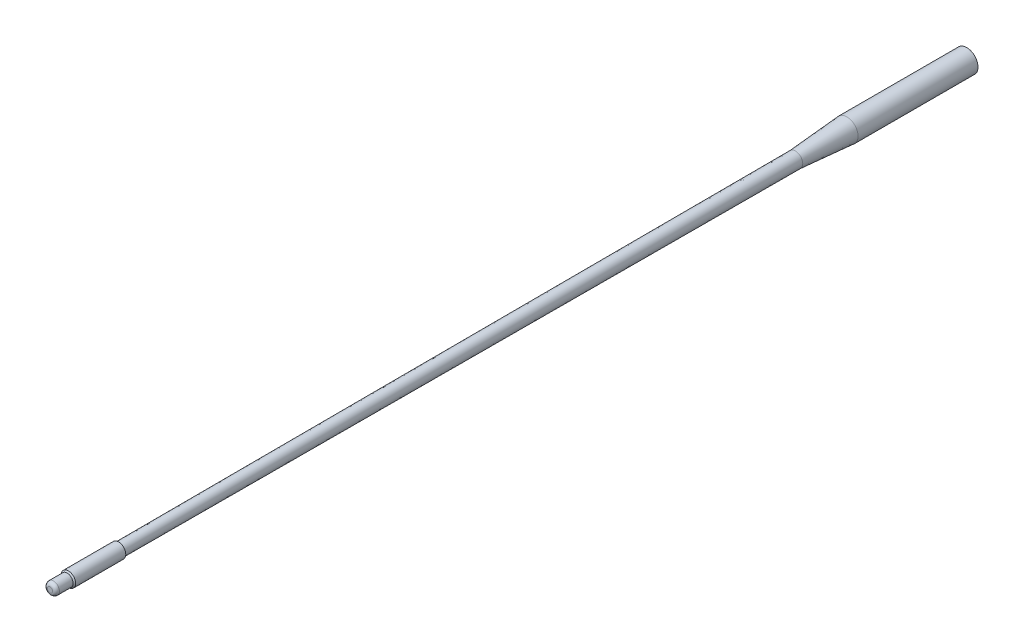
ISO-10303-21;
HEADER;
FILE_DESCRIPTION(('STEP AP214'),'2;1');
FILE_NAME('part.step','',(''),(''),'','','');
FILE_SCHEMA(('AUTOMOTIVE_DESIGN { 1 0 10303 214 1 1 1 1 }'));
ENDSEC;
DATA;
#1=APPLICATION_CONTEXT('core data for automotive mechanical design processes');
#2=APPLICATION_PROTOCOL_DEFINITION('international standard','automotive_design',2000,#1);
#3=PRODUCT_CONTEXT('',#1,'mechanical');
#4=PRODUCT('Part','Part','',(#3));
#5=PRODUCT_RELATED_PRODUCT_CATEGORY('part','',(#4));
#6=PRODUCT_DEFINITION_FORMATION('','',#4);
#7=PRODUCT_DEFINITION_CONTEXT('part definition',#1,'design');
#8=PRODUCT_DEFINITION('design','',#6,#7);
#9=PRODUCT_DEFINITION_SHAPE('','',#8);
#10=(LENGTH_UNIT() NAMED_UNIT(*) SI_UNIT(.MILLI.,.METRE.));
#11=(NAMED_UNIT(*) PLANE_ANGLE_UNIT() SI_UNIT($,.RADIAN.));
#12=(NAMED_UNIT(*) SI_UNIT($,.STERADIAN.) SOLID_ANGLE_UNIT());
#13=UNCERTAINTY_MEASURE_WITH_UNIT(LENGTH_MEASURE(1.E-05),#10,'distance_accuracy_value','');
#14=(GEOMETRIC_REPRESENTATION_CONTEXT(3) GLOBAL_UNCERTAINTY_ASSIGNED_CONTEXT((#13)) GLOBAL_UNIT_ASSIGNED_CONTEXT((#10,
#11,#12)) REPRESENTATION_CONTEXT('',''));
#15=CARTESIAN_POINT('',(0.,0.,0.));
#16=DIRECTION('',(0.,0.,1.));
#17=DIRECTION('',(1.,0.,0.));
#18=AXIS2_PLACEMENT_3D('',#15,#16,#17);
#19=CARTESIAN_POINT('',(0.,0.,127.));
#20=DIRECTION('',(0.,0.,-1.));
#21=DIRECTION('',(-1.,0.,0.));
#22=AXIS2_PLACEMENT_3D('',#19,#20,#21);
#23=CYLINDRICAL_SURFACE('',#22,8.3566);
#24=CARTESIAN_POINT('',(0.,0.,88.9));
#25=DIRECTION('',(0.,0.,1.));
#26=DIRECTION('',(1.,0.,0.));
#27=AXIS2_PLACEMENT_3D('',#24,#25,#26);
#28=CIRCLE('',#27,8.3566);
#29=CARTESIAN_POINT('',(8.3566,0.,88.9));
#30=VERTEX_POINT('',#29);
#31=EDGE_CURVE('E48',#30,#30,#28,.F.);
#32=ORIENTED_EDGE('',*,*,#31,.T.);
#33=EDGE_LOOP('',(#32));
#34=FACE_BOUND('',#33,.T.);
#35=CARTESIAN_POINT('',(0.,0.,0.));
#36=DIRECTION('',(0.,0.,1.));
#37=DIRECTION('',(1.,0.,0.));
#38=AXIS2_PLACEMENT_3D('',#35,#36,#37);
#39=CIRCLE('',#38,8.3566);
#40=CARTESIAN_POINT('',(8.3566,0.,0.));
#41=VERTEX_POINT('',#40);
#42=EDGE_CURVE('E54',#41,#41,#39,.T.);
#43=ORIENTED_EDGE('',*,*,#42,.T.);
#44=EDGE_LOOP('',(#43));
#45=FACE_BOUND('',#44,.T.);
#46=ADVANCED_FACE('F26',(#34,#45),#23,.T.);
#47=CARTESIAN_POINT('',(0.,0.,0.));
#48=DIRECTION('',(0.,0.,1.));
#49=DIRECTION('',(1.,0.,0.));
#50=AXIS2_PLACEMENT_3D('',#47,#48,#49);
#51=PLANE('',#50);
#52=ORIENTED_EDGE('',*,*,#42,.F.);
#53=EDGE_LOOP('',(#52));
#54=FACE_BOUND('',#53,.T.);
#55=ADVANCED_FACE('F77',(#54),#51,.F.);
#56=CARTESIAN_POINT('',(0.,0.,127.));
#57=DIRECTION('',(0.,0.,-1.));
#58=DIRECTION('',(-1.,0.,0.));
#59=AXIS2_PLACEMENT_3D('',#56,#57,#58);
#60=CONICAL_SURFACE('',#59,5.4864,0.0751913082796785);
#61=ORIENTED_EDGE('',*,*,#31,.F.);
#62=EDGE_LOOP('',(#61));
#63=FACE_BOUND('',#62,.T.);
#64=CARTESIAN_POINT('',(0.,0.,127.));
#65=DIRECTION('',(0.,0.,1.));
#66=DIRECTION('',(1.,0.,0.));
#67=AXIS2_PLACEMENT_3D('',#64,#65,#66);
#68=CIRCLE('',#67,5.4864);
#69=CARTESIAN_POINT('',(5.4864,0.,127.));
#70=VERTEX_POINT('',#69);
#71=EDGE_CURVE('E51',#70,#70,#68,.T.);
#72=ORIENTED_EDGE('',*,*,#71,.F.);
#73=EDGE_LOOP('',(#72));
#74=FACE_BOUND('',#73,.T.);
#75=ADVANCED_FACE('F71',(#63,#74),#60,.T.);
#76=CARTESIAN_POINT('',(0.,0.,628.65));
#77=DIRECTION('',(0.,0.,-1.));
#78=DIRECTION('',(-1.,0.,0.));
#79=AXIS2_PLACEMENT_3D('',#76,#77,#78);
#80=CONICAL_SURFACE('',#79,4.4704,0.00202531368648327);
#81=ORIENTED_EDGE('',*,*,#71,.T.);
#82=EDGE_LOOP('',(#81));
#83=FACE_BOUND('',#82,.T.);
#84=CARTESIAN_POINT('',(0.,0.,628.65));
#85=DIRECTION('',(0.,0.,1.));
#86=DIRECTION('',(1.,0.,0.));
#87=AXIS2_PLACEMENT_3D('',#84,#85,#86);
#88=CIRCLE('',#87,4.4704);
#89=CARTESIAN_POINT('',(4.4704,0.,628.65));
#90=VERTEX_POINT('',#89);
#91=EDGE_CURVE('E45',#90,#90,#88,.T.);
#92=ORIENTED_EDGE('',*,*,#91,.F.);
#93=EDGE_LOOP('',(#92));
#94=FACE_BOUND('',#93,.T.);
#95=ADVANCED_FACE('F66',(#83,#94),#80,.T.);
#96=CARTESIAN_POINT('',(0.,0.,628.65));
#97=DIRECTION('',(0.,0.,1.));
#98=DIRECTION('',(1.,0.,0.));
#99=AXIS2_PLACEMENT_3D('',#96,#97,#98);
#100=PLANE('',#99);
#101=CARTESIAN_POINT('',(0.,0.,628.65));
#102=DIRECTION('',(0.,0.,1.));
#103=DIRECTION('',(1.,0.,0.));
#104=AXIS2_PLACEMENT_3D('',#101,#102,#103);
#105=CIRCLE('',#104,5.3721);
#106=CARTESIAN_POINT('',(-5.3721,0.,628.65));
#107=VERTEX_POINT('',#106);
#108=EDGE_CURVE('E57',#107,#107,#105,.T.);
#109=ORIENTED_EDGE('',*,*,#108,.F.);
#110=EDGE_LOOP('',(#109));
#111=FACE_BOUND('',#110,.T.);
#112=ORIENTED_EDGE('',*,*,#91,.T.);
#113=EDGE_LOOP('',(#112));
#114=FACE_BOUND('',#113,.T.);
#115=ADVANCED_FACE('F63',(#111,#114),#100,.F.);
#116=CARTESIAN_POINT('',(0.,0.,666.75));
#117=DIRECTION('',(0.,0.,-1.));
#118=DIRECTION('',(-1.,0.,0.));
#119=AXIS2_PLACEMENT_3D('',#116,#117,#118);
#120=CYLINDRICAL_SURFACE('',#119,5.3721);
#121=CARTESIAN_POINT('',(0.,0.,665.8229));
#122=DIRECTION('',(0.,0.,1.));
#123=DIRECTION('',(1.,0.,0.));
#124=AXIS2_PLACEMENT_3D('',#121,#122,#123);
#125=CIRCLE('',#124,5.3721);
#126=CARTESIAN_POINT('',(-5.3721,0.,665.8229));
#127=VERTEX_POINT('',#126);
#128=EDGE_CURVE('E36',#127,#127,#125,.F.);
#129=CARTESIAN_POINT('',(-5.3721,0.,665.8229));
#130=CARTESIAN_POINT('',(-5.3721,0.,665.435682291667));
#131=CARTESIAN_POINT('',(-5.3721,0.,665.048464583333));
#132=CARTESIAN_POINT('',(-5.3721,0.,664.274029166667));
#133=CARTESIAN_POINT('',(-5.3721,0.,663.886811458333));
#134=CARTESIAN_POINT('',(-5.3721,0.,663.112376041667));
#135=CARTESIAN_POINT('',(-5.3721,0.,662.725158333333));
#136=CARTESIAN_POINT('',(-5.3721,0.,661.950722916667));
#137=CARTESIAN_POINT('',(-5.3721,0.,661.563505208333));
#138=CARTESIAN_POINT('',(-5.3721,0.,660.789069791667));
#139=CARTESIAN_POINT('',(-5.3721,0.,660.401852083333));
#140=CARTESIAN_POINT('',(-5.3721,0.,659.627416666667));
#141=CARTESIAN_POINT('',(-5.3721,0.,659.240198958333));
#142=CARTESIAN_POINT('',(-5.3721,0.,658.465763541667));
#143=CARTESIAN_POINT('',(-5.3721,0.,658.078545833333));
#144=CARTESIAN_POINT('',(-5.3721,0.,657.304110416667));
#145=CARTESIAN_POINT('',(-5.3721,0.,656.916892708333));
#146=CARTESIAN_POINT('',(-5.3721,0.,656.142457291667));
#147=CARTESIAN_POINT('',(-5.3721,0.,655.755239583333));
#148=CARTESIAN_POINT('',(-5.3721,0.,654.980804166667));
#149=CARTESIAN_POINT('',(-5.3721,0.,654.593586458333));
#150=CARTESIAN_POINT('',(-5.3721,0.,653.819151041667));
#151=CARTESIAN_POINT('',(-5.3721,0.,653.431933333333));
#152=CARTESIAN_POINT('',(-5.3721,0.,652.657497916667));
#153=CARTESIAN_POINT('',(-5.3721,0.,652.270280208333));
#154=CARTESIAN_POINT('',(-5.3721,0.,651.495844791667));
#155=CARTESIAN_POINT('',(-5.3721,0.,651.108627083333));
#156=CARTESIAN_POINT('',(-5.3721,0.,650.334191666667));
#157=CARTESIAN_POINT('',(-5.3721,0.,649.946973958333));
#158=CARTESIAN_POINT('',(-5.3721,0.,649.172538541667));
#159=CARTESIAN_POINT('',(-5.3721,0.,648.785320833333));
#160=CARTESIAN_POINT('',(-5.3721,0.,648.010885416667));
#161=CARTESIAN_POINT('',(-5.3721,0.,647.623667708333));
#162=CARTESIAN_POINT('',(-5.3721,0.,646.849232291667));
#163=CARTESIAN_POINT('',(-5.3721,0.,646.462014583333));
#164=CARTESIAN_POINT('',(-5.3721,0.,645.687579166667));
#165=CARTESIAN_POINT('',(-5.3721,0.,645.300361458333));
#166=CARTESIAN_POINT('',(-5.3721,0.,644.525926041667));
#167=CARTESIAN_POINT('',(-5.3721,0.,644.138708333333));
#168=CARTESIAN_POINT('',(-5.3721,0.,643.364272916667));
#169=CARTESIAN_POINT('',(-5.3721,0.,642.977055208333));
#170=CARTESIAN_POINT('',(-5.3721,0.,642.202619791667));
#171=CARTESIAN_POINT('',(-5.3721,0.,641.815402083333));
#172=CARTESIAN_POINT('',(-5.3721,0.,641.040966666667));
#173=CARTESIAN_POINT('',(-5.3721,0.,640.653748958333));
#174=CARTESIAN_POINT('',(-5.3721,0.,639.879313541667));
#175=CARTESIAN_POINT('',(-5.3721,0.,639.492095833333));
#176=CARTESIAN_POINT('',(-5.3721,0.,638.717660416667));
#177=CARTESIAN_POINT('',(-5.3721,0.,638.330442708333));
#178=CARTESIAN_POINT('',(-5.3721,0.,637.556007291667));
#179=CARTESIAN_POINT('',(-5.3721,0.,637.168789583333));
#180=CARTESIAN_POINT('',(-5.3721,0.,636.394354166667));
#181=CARTESIAN_POINT('',(-5.3721,0.,636.007136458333));
#182=CARTESIAN_POINT('',(-5.3721,0.,635.232701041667));
#183=CARTESIAN_POINT('',(-5.3721,0.,634.845483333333));
#184=CARTESIAN_POINT('',(-5.3721,0.,634.071047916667));
#185=CARTESIAN_POINT('',(-5.3721,0.,633.683830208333));
#186=CARTESIAN_POINT('',(-5.3721,0.,632.909394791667));
#187=CARTESIAN_POINT('',(-5.3721,0.,632.522177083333));
#188=CARTESIAN_POINT('',(-5.3721,0.,631.747741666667));
#189=CARTESIAN_POINT('',(-5.3721,0.,631.360523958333));
#190=CARTESIAN_POINT('',(-5.3721,0.,630.586088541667));
#191=CARTESIAN_POINT('',(-5.3721,0.,630.198870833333));
#192=CARTESIAN_POINT('',(-5.3721,0.,629.424435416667));
#193=CARTESIAN_POINT('',(-5.3721,0.,629.037217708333));
#194=CARTESIAN_POINT('',(-5.3721,0.,628.65));
#195=B_SPLINE_CURVE_WITH_KNOTS('',3,(#129,#130,#131,#132,#133,#134,#135,#136,#137,#138,#139,
#140,#141,#142,#143,#144,#145,#146,#147,#148,#149,#150,#151,#152,#153,#154,#155,#156,#157,#158,
#159,#160,#161,#162,#163,#164,#165,#166,#167,#168,#169,#170,#171,#172,#173,#174,#175,#176,#177,
#178,#179,#180,#181,#182,#183,#184,#185,#186,#187,#188,#189,#190,#191,#192,#193,#194),
.UNSPECIFIED.,.F.,.F.,(4,2,2,2,2,2,2,2,2,2,2,2,2,2,2,2,2,2,2,2,2,2,2,2,2,2,2,2,2,2,2,2,4),(0.,
1.16165312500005,2.3233062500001,3.48495937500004,4.64661250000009,5.80826562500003,
6.96991875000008,8.13157187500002,9.29322500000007,10.4548781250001,11.6165312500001,
12.7781843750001,13.9398375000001,15.1014906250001,16.26314375,17.4247968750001,18.58645,
19.7481031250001,20.9097562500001,22.0714093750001,23.2330625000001,24.3947156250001,
25.5563687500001,26.7180218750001,27.8796750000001,29.0413281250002,30.2029812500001,
31.3646343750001,32.5262875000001,33.6879406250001,34.8495937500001,36.0112468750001,
37.1729000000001),.UNSPECIFIED.);
#196=EDGE_CURVE('BSEAM61',#127,#107,#195,.T.);
#197=ORIENTED_EDGE('',*,*,#128,.T.);
#198=ORIENTED_EDGE('',*,*,#108,.T.);
#199=ORIENTED_EDGE('',*,*,#196,.T.);
#200=ORIENTED_EDGE('',*,*,#196,.F.);
#201=EDGE_LOOP('',(#197,#199,#198,#200));
#202=FACE_BOUND('',#201,.T.);
#203=ADVANCED_FACE('F61',(#202),#120,.T.);
#204=CARTESIAN_POINT('',(0.,0.,666.75));
#205=DIRECTION('',(0.,0.,-1.));
#206=DIRECTION('',(-1.,0.,0.));
#207=AXIS2_PLACEMENT_3D('',#204,#205,#206);
#208=CONICAL_SURFACE('',#207,4.445,0.785398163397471);
#209=ORIENTED_EDGE('',*,*,#128,.F.);
#210=EDGE_LOOP('',(#209));
#211=FACE_BOUND('',#210,.T.);
#212=CARTESIAN_POINT('',(0.,0.,666.75));
#213=DIRECTION('',(0.,0.,1.));
#214=DIRECTION('',(1.,0.,0.));
#215=AXIS2_PLACEMENT_3D('',#212,#213,#214);
#216=CIRCLE('',#215,4.445);
#217=CARTESIAN_POINT('',(4.445,0.,666.75));
#218=VERTEX_POINT('',#217);
#219=EDGE_CURVE('E40',#218,#218,#216,.T.);
#220=ORIENTED_EDGE('',*,*,#219,.F.);
#221=EDGE_LOOP('',(#220));
#222=FACE_BOUND('',#221,.T.);
#223=ADVANCED_FACE('F117',(#211,#222),#208,.T.);
#224=CARTESIAN_POINT('',(0.,0.,679.45));
#225=DIRECTION('',(0.,0.,-1.));
#226=DIRECTION('',(-1.,0.,0.));
#227=AXIS2_PLACEMENT_3D('',#224,#225,#226);
#228=CYLINDRICAL_SURFACE('',#227,4.445);
#229=CARTESIAN_POINT('',(0.,0.,676.91));
#230=DIRECTION('',(0.,0.,1.));
#231=DIRECTION('',(1.,0.,0.));
#232=AXIS2_PLACEMENT_3D('',#229,#230,#231);
#233=CIRCLE('',#232,4.445);
#234=CARTESIAN_POINT('',(4.445,0.,676.91));
#235=VERTEX_POINT('',#234);
#236=EDGE_CURVE('E10',#235,#235,#233,.F.);
#237=ORIENTED_EDGE('',*,*,#236,.T.);
#238=EDGE_LOOP('',(#237));
#239=FACE_BOUND('',#238,.T.);
#240=ORIENTED_EDGE('',*,*,#219,.T.);
#241=EDGE_LOOP('',(#240));
#242=FACE_BOUND('',#241,.T.);
#243=ADVANCED_FACE('F126',(#239,#242),#228,.T.);
#244=CARTESIAN_POINT('',(0.,0.,679.45));
#245=DIRECTION('',(0.,0.,1.));
#246=DIRECTION('',(1.,0.,0.));
#247=AXIS2_PLACEMENT_3D('',#244,#245,#246);
#248=PLANE('',#247);
#249=CARTESIAN_POINT('',(0.,0.,679.45));
#250=DIRECTION('',(0.,0.,1.));
#251=DIRECTION('',(1.,0.,0.));
#252=AXIS2_PLACEMENT_3D('',#249,#250,#251);
#253=CIRCLE('',#252,1.905);
#254=CARTESIAN_POINT('',(1.905,0.,679.45));
#255=VERTEX_POINT('',#254);
#256=EDGE_CURVE('E32',#255,#255,#253,.T.);
#257=ORIENTED_EDGE('',*,*,#256,.T.);
#258=EDGE_LOOP('',(#257));
#259=FACE_BOUND('',#258,.T.);
#260=ADVANCED_FACE('F136',(#259),#248,.T.);
#261=CARTESIAN_POINT('',(0.,0.,676.91));
#262=DIRECTION('',(0.,0.,1.));
#263=DIRECTION('',(1.,0.,0.));
#264=AXIS2_PLACEMENT_3D('',#261,#262,#263);
#265=DEGENERATE_TOROIDAL_SURFACE('',#264,1.905,2.54,.T.);
#266=ORIENTED_EDGE('',*,*,#236,.F.);
#267=EDGE_LOOP('',(#266));
#268=FACE_BOUND('',#267,.T.);
#269=ORIENTED_EDGE('',*,*,#256,.F.);
#270=EDGE_LOOP('',(#269));
#271=FACE_BOUND('',#270,.T.);
#272=ADVANCED_FACE('F145',(#268,#271),#265,.T.);
#273=CLOSED_SHELL('',(#46,#55,#75,#95,#115,#203,#223,#243,#260,#272));
#274=MANIFOLD_SOLID_BREP('B2',#273);
#275=ADVANCED_BREP_SHAPE_REPRESENTATION('',(#18,#274),#14);
#276=SHAPE_DEFINITION_REPRESENTATION(#9,#275);
ENDSEC;
END-ISO-10303-21;
